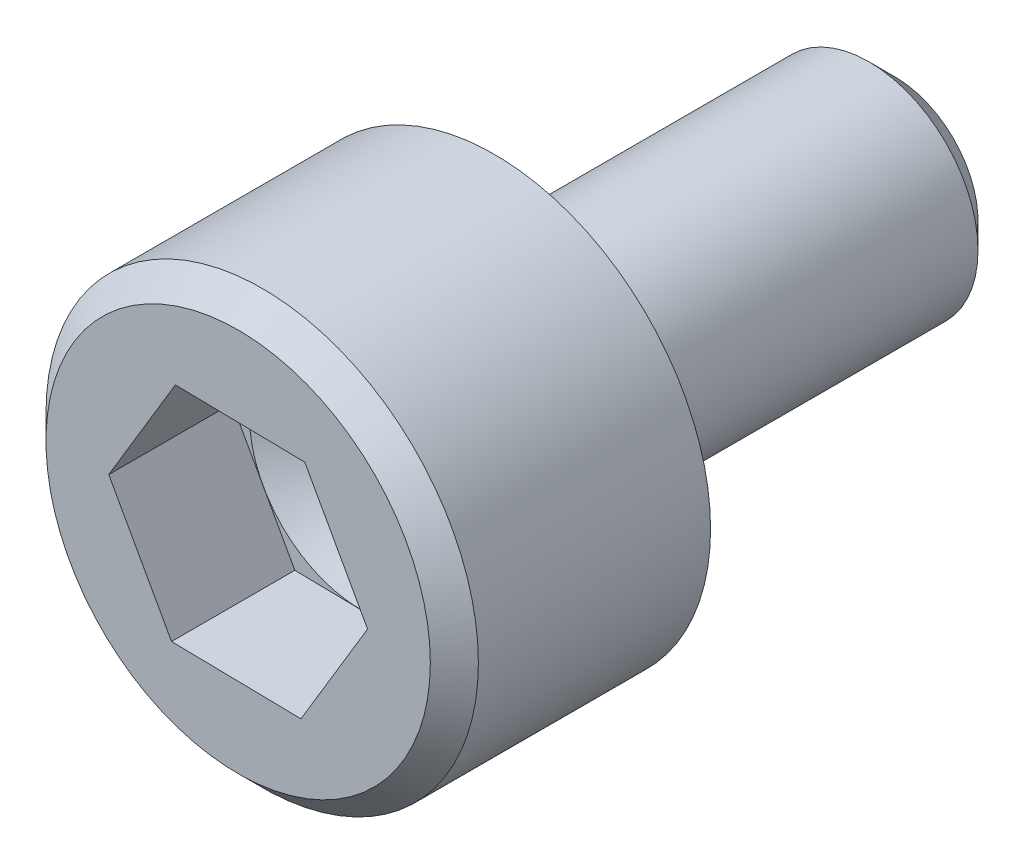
ISO-10303-21;
HEADER;
FILE_DESCRIPTION(('STEP AP214'),'2;1');
FILE_NAME('part.step','',(''),(''),'','','');
FILE_SCHEMA(('AUTOMOTIVE_DESIGN { 1 0 10303 214 1 1 1 1 }'));
ENDSEC;
DATA;
#1=APPLICATION_CONTEXT('core data for automotive mechanical design processes');
#2=APPLICATION_PROTOCOL_DEFINITION('international standard','automotive_design',2000,#1);
#3=PRODUCT_CONTEXT('',#1,'mechanical');
#4=PRODUCT('Part','Part','',(#3));
#5=PRODUCT_RELATED_PRODUCT_CATEGORY('part','',(#4));
#6=PRODUCT_DEFINITION_FORMATION('','',#4);
#7=PRODUCT_DEFINITION_CONTEXT('part definition',#1,'design');
#8=PRODUCT_DEFINITION('design','',#6,#7);
#9=PRODUCT_DEFINITION_SHAPE('','',#8);
#10=(LENGTH_UNIT() NAMED_UNIT(*) SI_UNIT(.MILLI.,.METRE.));
#11=(NAMED_UNIT(*) PLANE_ANGLE_UNIT() SI_UNIT($,.RADIAN.));
#12=(NAMED_UNIT(*) SI_UNIT($,.STERADIAN.) SOLID_ANGLE_UNIT());
#13=UNCERTAINTY_MEASURE_WITH_UNIT(LENGTH_MEASURE(1.E-05),#10,'distance_accuracy_value','');
#14=(GEOMETRIC_REPRESENTATION_CONTEXT(3) GLOBAL_UNCERTAINTY_ASSIGNED_CONTEXT((#13)) GLOBAL_UNIT_ASSIGNED_CONTEXT((#10,
#11,#12)) REPRESENTATION_CONTEXT('',''));
#15=CARTESIAN_POINT('',(0.,0.,0.));
#16=DIRECTION('',(0.,0.,1.));
#17=DIRECTION('',(1.,0.,0.));
#18=AXIS2_PLACEMENT_3D('',#15,#16,#17);
#19=CARTESIAN_POINT('',(0.,0.,-4.064));
#20=DIRECTION('',(0.,0.,1.));
#21=DIRECTION('',(1.,0.,0.));
#22=AXIS2_PLACEMENT_3D('',#19,#20,#21);
#23=PLANE('',#22);
#24=CARTESIAN_POINT('',(0.,0.,-4.064));
#25=DIRECTION('',(0.,0.,1.));
#26=DIRECTION('',(1.,0.,0.));
#27=AXIS2_PLACEMENT_3D('',#24,#25,#26);
#28=CIRCLE('',#27,3.429);
#29=CARTESIAN_POINT('',(3.429,0.,-4.064));
#30=VERTEX_POINT('',#29);
#31=EDGE_CURVE('E172',#30,#30,#28,.T.);
#32=ORIENTED_EDGE('',*,*,#31,.F.);
#33=EDGE_LOOP('',(#32));
#34=FACE_BOUND('',#33,.T.);
#35=CARTESIAN_POINT('',(0.,0.,-4.064));
#36=DIRECTION('',(0.,0.,1.));
#37=DIRECTION('',(1.,0.,0.));
#38=AXIS2_PLACEMENT_3D('',#35,#36,#37);
#39=CIRCLE('',#38,1.7272);
#40=CARTESIAN_POINT('',(1.7272,0.,-4.064));
#41=VERTEX_POINT('',#40);
#42=EDGE_CURVE('E185',#41,#41,#39,.F.);
#43=ORIENTED_EDGE('',*,*,#42,.F.);
#44=EDGE_LOOP('',(#43));
#45=FACE_BOUND('',#44,.T.);
#46=ADVANCED_FACE('F41',(#34,#45),#23,.F.);
#47=CARTESIAN_POINT('',(0.,0.,-4.064));
#48=DIRECTION('',(0.,0.,1.));
#49=DIRECTION('',(1.,0.,0.));
#50=AXIS2_PLACEMENT_3D('',#47,#48,#49);
#51=CYLINDRICAL_SURFACE('',#50,3.429);
#52=CARTESIAN_POINT('',(0.,0.,-0.381000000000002));
#53=DIRECTION('',(0.,0.,1.));
#54=DIRECTION('',(1.,0.,0.));
#55=AXIS2_PLACEMENT_3D('',#52,#53,#54);
#56=CIRCLE('',#55,3.429);
#57=CARTESIAN_POINT('',(3.429,0.,-0.381000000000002));
#58=VERTEX_POINT('',#57);
#59=EDGE_CURVE('E193',#58,#58,#56,.F.);
#60=ORIENTED_EDGE('',*,*,#59,.T.);
#61=EDGE_LOOP('',(#60));
#62=FACE_BOUND('',#61,.T.);
#63=ORIENTED_EDGE('',*,*,#31,.T.);
#64=EDGE_LOOP('',(#63));
#65=FACE_BOUND('',#64,.T.);
#66=ADVANCED_FACE('F215',(#62,#65),#51,.T.);
#67=CARTESIAN_POINT('',(0.,0.,0.));
#68=DIRECTION('',(0.,0.,1.));
#69=DIRECTION('',(1.,0.,0.));
#70=AXIS2_PLACEMENT_3D('',#67,#68,#69);
#71=PLANE('',#70);
#72=DIRECTION('',(-0.485142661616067,0.87443501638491,0.));
#73=VECTOR('',#72,1.);
#74=CARTESIAN_POINT('',(2.05275836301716,-0.0350490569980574,0.));
#75=LINE('',#74,#73);
#76=CARTESIAN_POINT('',(2.05275836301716,-0.0350490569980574,0.));
#77=VERTEX_POINT('',#76);
#78=CARTESIAN_POINT('',(1.05673255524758,1.76021636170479,0.));
#79=VERTEX_POINT('',#78);
#80=EDGE_CURVE('E60',#77,#79,#75,.T.);
#81=ORIENTED_EDGE('',*,*,#80,.F.);
#82=DIRECTION('',(0.514711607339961,0.857363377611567,0.));
#83=VECTOR('',#82,1.);
#84=CARTESIAN_POINT('',(0.996025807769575,-1.79526541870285,0.));
#85=LINE('',#84,#83);
#86=CARTESIAN_POINT('',(0.996025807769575,-1.79526541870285,0.));
#87=VERTEX_POINT('',#86);
#88=EDGE_CURVE('E166',#87,#77,#85,.T.);
#89=ORIENTED_EDGE('',*,*,#88,.F.);
#90=DIRECTION('',(0.999854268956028,-0.0170716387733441,0.));
#91=VECTOR('',#90,1.);
#92=CARTESIAN_POINT('',(-1.05673255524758,-1.76021636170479,0.));
#93=LINE('',#92,#91);
#94=CARTESIAN_POINT('',(-1.05673255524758,-1.76021636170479,0.));
#95=VERTEX_POINT('',#94);
#96=EDGE_CURVE('E163',#95,#87,#93,.T.);
#97=ORIENTED_EDGE('',*,*,#96,.F.);
#98=DIRECTION('',(0.485142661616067,-0.874435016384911,0.));
#99=VECTOR('',#98,1.);
#100=CARTESIAN_POINT('',(-2.05275836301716,0.0350490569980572,0.));
#101=LINE('',#100,#99);
#102=CARTESIAN_POINT('',(-2.05275836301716,0.0350490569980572,0.));
#103=VERTEX_POINT('',#102);
#104=EDGE_CURVE('E120',#103,#95,#101,.T.);
#105=ORIENTED_EDGE('',*,*,#104,.F.);
#106=DIRECTION('',(-0.514711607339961,-0.857363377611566,0.));
#107=VECTOR('',#106,1.);
#108=CARTESIAN_POINT('',(-0.996025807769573,1.79526541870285,0.));
#109=LINE('',#108,#107);
#110=CARTESIAN_POINT('',(-0.996025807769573,1.79526541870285,0.));
#111=VERTEX_POINT('',#110);
#112=EDGE_CURVE('E157',#111,#103,#109,.T.);
#113=ORIENTED_EDGE('',*,*,#112,.F.);
#114=DIRECTION('',(-0.999854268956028,0.0170716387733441,0.));
#115=VECTOR('',#114,1.);
#116=CARTESIAN_POINT('',(1.05673255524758,1.76021636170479,0.));
#117=LINE('',#116,#115);
#118=EDGE_CURVE('E152',#79,#111,#117,.T.);
#119=ORIENTED_EDGE('',*,*,#118,.F.);
#120=EDGE_LOOP('',(#81,#89,#97,#105,#113,#119));
#121=FACE_BOUND('',#120,.T.);
#122=CARTESIAN_POINT('',(0.,0.,0.));
#123=DIRECTION('',(0.,0.,1.));
#124=DIRECTION('',(1.,0.,0.));
#125=AXIS2_PLACEMENT_3D('',#122,#123,#124);
#126=CIRCLE('',#125,3.048);
#127=CARTESIAN_POINT('',(3.048,0.,0.));
#128=VERTEX_POINT('',#127);
#129=EDGE_CURVE('E189',#128,#128,#126,.T.);
#130=ORIENTED_EDGE('',*,*,#129,.T.);
#131=EDGE_LOOP('',(#130));
#132=FACE_BOUND('',#131,.T.);
#133=ADVANCED_FACE('F221',(#121,#132),#71,.T.);
#134=CARTESIAN_POINT('',(0.,0.,-10.414));
#135=DIRECTION('',(0.,0.,1.));
#136=DIRECTION('',(1.,0.,0.));
#137=AXIS2_PLACEMENT_3D('',#134,#135,#136);
#138=CYLINDRICAL_SURFACE('',#137,1.7272);
#139=CARTESIAN_POINT('',(0.,0.,-10.0076));
#140=DIRECTION('',(0.,0.,-1.));
#141=DIRECTION('',(-1.,0.,0.));
#142=AXIS2_PLACEMENT_3D('',#139,#140,#141);
#143=CIRCLE('',#142,1.7272);
#144=CARTESIAN_POINT('',(-1.7272,0.,-10.0076));
#145=VERTEX_POINT('',#144);
#146=EDGE_CURVE('E11',#145,#145,#143,.F.);
#147=ORIENTED_EDGE('',*,*,#146,.T.);
#148=EDGE_LOOP('',(#147));
#149=FACE_BOUND('',#148,.T.);
#150=ORIENTED_EDGE('',*,*,#42,.T.);
#151=EDGE_LOOP('',(#150));
#152=FACE_BOUND('',#151,.T.);
#153=ADVANCED_FACE('F228',(#149,#152),#138,.T.);
#154=CARTESIAN_POINT('',(0.,0.,-10.414));
#155=DIRECTION('',(0.,0.,-1.));
#156=DIRECTION('',(-1.,0.,0.));
#157=AXIS2_PLACEMENT_3D('',#154,#155,#156);
#158=PLANE('',#157);
#159=CARTESIAN_POINT('',(0.,0.,-10.414));
#160=DIRECTION('',(0.,0.,-1.));
#161=DIRECTION('',(-1.,0.,0.));
#162=AXIS2_PLACEMENT_3D('',#159,#160,#161);
#163=CIRCLE('',#162,1.3208);
#164=CARTESIAN_POINT('',(-1.3208,0.,-10.414));
#165=VERTEX_POINT('',#164);
#166=EDGE_CURVE('E50',#165,#165,#163,.T.);
#167=ORIENTED_EDGE('',*,*,#166,.T.);
#168=EDGE_LOOP('',(#167));
#169=FACE_BOUND('',#168,.T.);
#170=ADVANCED_FACE('F200',(#169),#158,.T.);
#171=CARTESIAN_POINT('',(0.,0.,0.));
#172=DIRECTION('',(0.,0.,-1.));
#173=DIRECTION('',(-1.,0.,0.));
#174=AXIS2_PLACEMENT_3D('',#171,#172,#173);
#175=CONICAL_SURFACE('',#174,3.048,0.785398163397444);
#176=ORIENTED_EDGE('',*,*,#59,.F.);
#177=EDGE_LOOP('',(#176));
#178=FACE_BOUND('',#177,.T.);
#179=ORIENTED_EDGE('',*,*,#129,.F.);
#180=EDGE_LOOP('',(#179));
#181=FACE_BOUND('',#180,.T.);
#182=ADVANCED_FACE('F204',(#178,#181),#175,.T.);
#183=CARTESIAN_POINT('',(0.,0.,-10.414));
#184=DIRECTION('',(0.,0.,1.));
#185=DIRECTION('',(1.,0.,0.));
#186=AXIS2_PLACEMENT_3D('',#183,#184,#185);
#187=CONICAL_SURFACE('',#186,1.3208,0.785398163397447);
#188=ORIENTED_EDGE('',*,*,#146,.F.);
#189=EDGE_LOOP('',(#188));
#190=FACE_BOUND('',#189,.T.);
#191=ORIENTED_EDGE('',*,*,#166,.F.);
#192=EDGE_LOOP('',(#191));
#193=FACE_BOUND('',#192,.T.);
#194=ADVANCED_FACE('F43',(#190,#193),#187,.T.);
#195=CARTESIAN_POINT('',(2.05275836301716,-0.0350490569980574,-1.9558));
#196=DIRECTION('',(0.87443501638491,0.485142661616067,0.));
#197=DIRECTION('',(-0.485142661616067,0.87443501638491,0.));
#198=AXIS2_PLACEMENT_3D('',#195,#196,#197);
#199=PLANE('',#198);
#200=ORIENTED_EDGE('',*,*,#80,.T.);
#201=DIRECTION('',(0.,0.,1.));
#202=VECTOR('',#201,1.);
#203=CARTESIAN_POINT('',(1.05673255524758,1.76021636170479,-1.9558));
#204=LINE('',#203,#202);
#205=CARTESIAN_POINT('',(1.05673255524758,1.76021636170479,-1.9558));
#206=VERTEX_POINT('',#205);
#207=EDGE_CURVE('E100',#206,#79,#204,.T.);
#208=ORIENTED_EDGE('',*,*,#207,.F.);
#209=DIRECTION('',(-0.485142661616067,0.87443501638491,0.));
#210=VECTOR('',#209,1.);
#211=CARTESIAN_POINT('',(2.05275836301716,-0.0350490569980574,-1.9558));
#212=LINE('',#211,#210);
#213=CARTESIAN_POINT('',(2.05275836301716,-0.0350490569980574,-1.9558));
#214=VERTEX_POINT('',#213);
#215=EDGE_CURVE('E169',#214,#206,#212,.T.);
#216=ORIENTED_EDGE('',*,*,#215,.F.);
#217=DIRECTION('',(0.,0.,1.));
#218=VECTOR('',#217,1.);
#219=CARTESIAN_POINT('',(2.05275836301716,-0.0350490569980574,-1.9558));
#220=LINE('',#219,#218);
#221=EDGE_CURVE('E69',#214,#77,#220,.T.);
#222=ORIENTED_EDGE('',*,*,#221,.T.);
#223=EDGE_LOOP('',(#200,#208,#216,#222));
#224=FACE_BOUND('',#223,.T.);
#225=ADVANCED_FACE('F203',(#224),#199,.F.);
#226=CARTESIAN_POINT('',(0.996025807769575,-1.79526541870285,-1.9558));
#227=DIRECTION('',(0.857363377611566,-0.514711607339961,0.));
#228=DIRECTION('',(0.514711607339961,0.857363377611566,0.));
#229=AXIS2_PLACEMENT_3D('',#226,#227,#228);
#230=PLANE('',#229);
#231=ORIENTED_EDGE('',*,*,#88,.T.);
#232=ORIENTED_EDGE('',*,*,#221,.F.);
#233=DIRECTION('',(0.514711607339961,0.857363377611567,0.));
#234=VECTOR('',#233,1.);
#235=CARTESIAN_POINT('',(0.996025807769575,-1.79526541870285,-1.9558));
#236=LINE('',#235,#234);
#237=CARTESIAN_POINT('',(0.996025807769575,-1.79526541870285,-1.9558));
#238=VERTEX_POINT('',#237);
#239=EDGE_CURVE('E134',#238,#214,#236,.T.);
#240=ORIENTED_EDGE('',*,*,#239,.F.);
#241=DIRECTION('',(0.,0.,1.));
#242=VECTOR('',#241,1.);
#243=CARTESIAN_POINT('',(0.996025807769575,-1.79526541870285,-1.9558));
#244=LINE('',#243,#242);
#245=EDGE_CURVE('E125',#238,#87,#244,.T.);
#246=ORIENTED_EDGE('',*,*,#245,.T.);
#247=EDGE_LOOP('',(#231,#232,#240,#246));
#248=FACE_BOUND('',#247,.T.);
#249=ADVANCED_FACE('F210',(#248),#230,.F.);
#250=CARTESIAN_POINT('',(-1.05673255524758,-1.76021636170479,-1.9558));
#251=DIRECTION('',(-0.0170716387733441,-0.999854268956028,0.));
#252=DIRECTION('',(0.999854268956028,-0.0170716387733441,0.));
#253=AXIS2_PLACEMENT_3D('',#250,#251,#252);
#254=PLANE('',#253);
#255=ORIENTED_EDGE('',*,*,#96,.T.);
#256=ORIENTED_EDGE('',*,*,#245,.F.);
#257=DIRECTION('',(0.999854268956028,-0.0170716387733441,0.));
#258=VECTOR('',#257,1.);
#259=CARTESIAN_POINT('',(-1.05673255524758,-1.76021636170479,-1.9558));
#260=LINE('',#259,#258);
#261=CARTESIAN_POINT('',(-1.05673255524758,-1.76021636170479,-1.9558));
#262=VERTEX_POINT('',#261);
#263=EDGE_CURVE('E129',#262,#238,#260,.T.);
#264=ORIENTED_EDGE('',*,*,#263,.F.);
#265=DIRECTION('',(0.,0.,1.));
#266=VECTOR('',#265,1.);
#267=CARTESIAN_POINT('',(-1.05673255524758,-1.76021636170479,-1.9558));
#268=LINE('',#267,#266);
#269=EDGE_CURVE('E113',#262,#95,#268,.T.);
#270=ORIENTED_EDGE('',*,*,#269,.T.);
#271=EDGE_LOOP('',(#255,#256,#264,#270));
#272=FACE_BOUND('',#271,.T.);
#273=ADVANCED_FACE('F130',(#272),#254,.F.);
#274=CARTESIAN_POINT('',(-2.05275836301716,0.0350490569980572,-1.9558));
#275=DIRECTION('',(-0.874435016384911,-0.485142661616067,0.));
#276=DIRECTION('',(0.485142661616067,-0.874435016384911,0.));
#277=AXIS2_PLACEMENT_3D('',#274,#275,#276);
#278=PLANE('',#277);
#279=ORIENTED_EDGE('',*,*,#104,.T.);
#280=ORIENTED_EDGE('',*,*,#269,.F.);
#281=DIRECTION('',(0.485142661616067,-0.874435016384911,0.));
#282=VECTOR('',#281,1.);
#283=CARTESIAN_POINT('',(-2.05275836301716,0.0350490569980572,-1.9558));
#284=LINE('',#283,#282);
#285=CARTESIAN_POINT('',(-2.05275836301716,0.0350490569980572,-1.9558));
#286=VERTEX_POINT('',#285);
#287=EDGE_CURVE('E117',#286,#262,#284,.T.);
#288=ORIENTED_EDGE('',*,*,#287,.F.);
#289=DIRECTION('',(0.,0.,1.));
#290=VECTOR('',#289,1.);
#291=CARTESIAN_POINT('',(-2.05275836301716,0.0350490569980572,-1.9558));
#292=LINE('',#291,#290);
#293=EDGE_CURVE('E126',#286,#103,#292,.T.);
#294=ORIENTED_EDGE('',*,*,#293,.T.);
#295=EDGE_LOOP('',(#279,#280,#288,#294));
#296=FACE_BOUND('',#295,.T.);
#297=ADVANCED_FACE('F115',(#296),#278,.F.);
#298=CARTESIAN_POINT('',(-0.996025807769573,1.79526541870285,-1.9558));
#299=DIRECTION('',(-0.857363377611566,0.514711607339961,0.));
#300=DIRECTION('',(-0.514711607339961,-0.857363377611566,0.));
#301=AXIS2_PLACEMENT_3D('',#298,#299,#300);
#302=PLANE('',#301);
#303=ORIENTED_EDGE('',*,*,#112,.T.);
#304=ORIENTED_EDGE('',*,*,#293,.F.);
#305=DIRECTION('',(-0.514711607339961,-0.857363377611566,0.));
#306=VECTOR('',#305,1.);
#307=CARTESIAN_POINT('',(-0.996025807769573,1.79526541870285,-1.9558));
#308=LINE('',#307,#306);
#309=CARTESIAN_POINT('',(-0.996025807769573,1.79526541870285,-1.9558));
#310=VERTEX_POINT('',#309);
#311=EDGE_CURVE('E140',#310,#286,#308,.T.);
#312=ORIENTED_EDGE('',*,*,#311,.F.);
#313=DIRECTION('',(0.,0.,1.));
#314=VECTOR('',#313,1.);
#315=CARTESIAN_POINT('',(-0.996025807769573,1.79526541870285,-1.9558));
#316=LINE('',#315,#314);
#317=EDGE_CURVE('E177',#310,#111,#316,.T.);
#318=ORIENTED_EDGE('',*,*,#317,.T.);
#319=EDGE_LOOP('',(#303,#304,#312,#318));
#320=FACE_BOUND('',#319,.T.);
#321=ADVANCED_FACE('F269',(#320),#302,.F.);
#322=CARTESIAN_POINT('',(1.05673255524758,1.76021636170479,-1.9558));
#323=DIRECTION('',(0.0170716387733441,0.999854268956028,0.));
#324=DIRECTION('',(-0.999854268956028,0.0170716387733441,0.));
#325=AXIS2_PLACEMENT_3D('',#322,#323,#324);
#326=PLANE('',#325);
#327=ORIENTED_EDGE('',*,*,#118,.T.);
#328=ORIENTED_EDGE('',*,*,#317,.F.);
#329=DIRECTION('',(-0.999854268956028,0.0170716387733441,0.));
#330=VECTOR('',#329,1.);
#331=CARTESIAN_POINT('',(1.05673255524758,1.76021636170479,-1.9558));
#332=LINE('',#331,#330);
#333=EDGE_CURVE('E145',#206,#310,#332,.T.);
#334=ORIENTED_EDGE('',*,*,#333,.F.);
#335=ORIENTED_EDGE('',*,*,#207,.T.);
#336=EDGE_LOOP('',(#327,#328,#334,#335));
#337=FACE_BOUND('',#336,.T.);
#338=ADVANCED_FACE('F243',(#337),#326,.F.);
#339=CARTESIAN_POINT('',(1.05673255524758,1.76021636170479,-1.9558));
#340=DIRECTION('',(0.,0.,1.));
#341=DIRECTION('',(1.,0.,0.));
#342=AXIS2_PLACEMENT_3D('',#339,#340,#341);
#343=PLANE('',#342);
#344=CARTESIAN_POINT('',(0.,0.,-1.9558));
#345=DIRECTION('',(0.,0.,-1.));
#346=DIRECTION('',(0.,1.,0.));
#347=AXIS2_PLACEMENT_3D('',#344,#345,#346);
#348=CIRCLE('',#347,1.77774089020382);
#349=CARTESIAN_POINT('',(0.,1.77774089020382,-1.9558));
#350=VERTEX_POINT('',#349);
#351=EDGE_CURVE('E153',#350,#350,#348,.T.);
#352=ORIENTED_EDGE('',*,*,#351,.T.);
#353=EDGE_LOOP('',(#352));
#354=FACE_BOUND('',#353,.T.);
#355=ORIENTED_EDGE('',*,*,#215,.T.);
#356=ORIENTED_EDGE('',*,*,#333,.T.);
#357=ORIENTED_EDGE('',*,*,#311,.T.);
#358=ORIENTED_EDGE('',*,*,#287,.T.);
#359=ORIENTED_EDGE('',*,*,#263,.T.);
#360=ORIENTED_EDGE('',*,*,#239,.T.);
#361=EDGE_LOOP('',(#355,#356,#357,#358,#359,#360));
#362=FACE_BOUND('',#361,.T.);
#363=ADVANCED_FACE('F137',(#354,#362),#343,.T.);
#364=CARTESIAN_POINT('',(0.,0.,-2.9718));
#365=DIRECTION('',(0.,0.,1.));
#366=DIRECTION('',(0.,-1.,0.));
#367=AXIS2_PLACEMENT_3D('',#364,#365,#366);
#368=CONICAL_SURFACE('',#367,0.,1.05158742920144);
#369=ORIENTED_EDGE('',*,*,#351,.F.);
#370=EDGE_LOOP('',(#369));
#371=FACE_BOUND('',#370,.T.);
#372=CARTESIAN_POINT('',(0.,0.,-2.9718));
#373=VERTEX_POINT('',#372);
#374=VERTEX_LOOP('',#373);
#375=FACE_BOUND('',#374,.T.);
#376=ADVANCED_FACE('F253',(#371,#375),#368,.F.);
#377=CLOSED_SHELL('',(#46,#66,#133,#153,#170,#182,#194,#225,#249,#273,#297,#321,#338,#363,#376));
#378=MANIFOLD_SOLID_BREP('B2',#377);
#379=ADVANCED_BREP_SHAPE_REPRESENTATION('',(#18,#378),#14);
#380=SHAPE_DEFINITION_REPRESENTATION(#9,#379);
ENDSEC;
END-ISO-10303-21;
